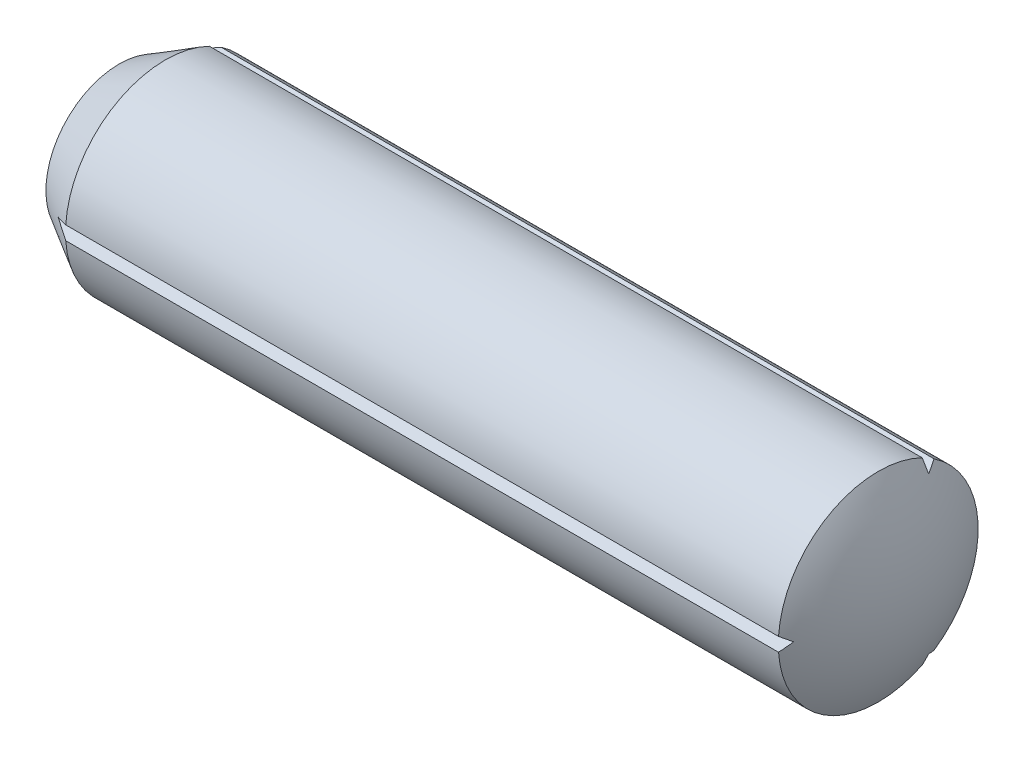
ISO-10303-21;
HEADER;
FILE_DESCRIPTION(('STEP AP214'),'2;1');
FILE_NAME('part.step','',(''),(''),'','','');
FILE_SCHEMA(('AUTOMOTIVE_DESIGN { 1 0 10303 214 1 1 1 1 }'));
ENDSEC;
DATA;
#1=APPLICATION_CONTEXT('core data for automotive mechanical design processes');
#2=APPLICATION_PROTOCOL_DEFINITION('international standard','automotive_design',2000,#1);
#3=PRODUCT_CONTEXT('',#1,'mechanical');
#4=PRODUCT('Part','Part','',(#3));
#5=PRODUCT_RELATED_PRODUCT_CATEGORY('part','',(#4));
#6=PRODUCT_DEFINITION_FORMATION('','',#4);
#7=PRODUCT_DEFINITION_CONTEXT('part definition',#1,'design');
#8=PRODUCT_DEFINITION('design','',#6,#7);
#9=PRODUCT_DEFINITION_SHAPE('','',#8);
#10=(LENGTH_UNIT() NAMED_UNIT(*) SI_UNIT(.MILLI.,.METRE.));
#11=(NAMED_UNIT(*) PLANE_ANGLE_UNIT() SI_UNIT($,.RADIAN.));
#12=(NAMED_UNIT(*) SI_UNIT($,.STERADIAN.) SOLID_ANGLE_UNIT());
#13=UNCERTAINTY_MEASURE_WITH_UNIT(LENGTH_MEASURE(1.E-05),#10,'distance_accuracy_value','');
#14=(GEOMETRIC_REPRESENTATION_CONTEXT(3) GLOBAL_UNCERTAINTY_ASSIGNED_CONTEXT((#13)) GLOBAL_UNIT_ASSIGNED_CONTEXT((#10,
#11,#12)) REPRESENTATION_CONTEXT('',''));
#15=CARTESIAN_POINT('',(0.,0.,0.));
#16=DIRECTION('',(0.,0.,1.));
#17=DIRECTION('',(1.,0.,0.));
#18=AXIS2_PLACEMENT_3D('',#15,#16,#17);
#19=CARTESIAN_POINT('',(-117.,0.,0.));
#20=DIRECTION('',(-1.,0.,0.));
#21=DIRECTION('',(0.,0.,1.));
#22=AXIS2_PLACEMENT_3D('',#19,#20,#21);
#23=CYLINDRICAL_SURFACE('',#22,12.5);
#24=CARTESIAN_POINT('',(-3.34936490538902,0.,0.));
#25=DIRECTION('',(-1.,0.,0.));
#26=DIRECTION('',(0.,0.,1.));
#27=AXIS2_PLACEMENT_3D('',#24,#25,#26);
#28=CIRCLE('',#27,12.5);
#29=CARTESIAN_POINT('',(-3.34936490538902,0.85477161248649,12.4707403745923));
#30=VERTEX_POINT('',#29);
#31=CARTESIAN_POINT('',(-3.34936490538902,11.2273637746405,-5.49511625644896));
#32=VERTEX_POINT('',#31);
#33=EDGE_CURVE('E191',#30,#32,#28,.T.);
#34=ORIENTED_EDGE('',*,*,#33,.T.);
#35=DIRECTION('',(-1.,0.,0.));
#36=VECTOR('',#35,1.);
#37=CARTESIAN_POINT('',(-117.,11.2273637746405,-5.49511625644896));
#38=LINE('',#37,#36);
#39=CARTESIAN_POINT('',(-92.5,11.2273637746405,-5.49511625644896));
#40=VERTEX_POINT('',#39);
#41=EDGE_CURVE('E108',#32,#40,#38,.T.);
#42=ORIENTED_EDGE('',*,*,#41,.T.);
#43=CARTESIAN_POINT('',(-92.5,0.,0.));
#44=DIRECTION('',(-1.,0.,0.));
#45=DIRECTION('',(0.,0.,1.));
#46=AXIS2_PLACEMENT_3D('',#43,#44,#45);
#47=CIRCLE('',#46,12.5);
#48=CARTESIAN_POINT('',(-92.5,0.854771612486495,12.4707403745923));
#49=VERTEX_POINT('',#48);
#50=EDGE_CURVE('E120',#49,#40,#47,.T.);
#51=ORIENTED_EDGE('',*,*,#50,.F.);
#52=DIRECTION('',(-1.,0.,0.));
#53=VECTOR('',#52,1.);
#54=CARTESIAN_POINT('',(-117.,0.854771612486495,12.4707403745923));
#55=LINE('',#54,#53);
#56=EDGE_CURVE('E162',#49,#30,#55,.F.);
#57=ORIENTED_EDGE('',*,*,#56,.T.);
#58=EDGE_LOOP('',(#34,#42,#51,#57));
#59=FACE_BOUND('',#58,.T.);
#60=ADVANCED_FACE('F32',(#59),#23,.T.);
#61=CARTESIAN_POINT('',(-92.5,10.372592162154,-6.97562411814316));
#62=VERTEX_POINT('',#61);
#63=CARTESIAN_POINT('',(-92.5,-10.3725921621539,-6.97562411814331));
#64=VERTEX_POINT('',#63);
#65=EDGE_CURVE('E204',#62,#64,#47,.T.);
#66=ORIENTED_EDGE('',*,*,#65,.F.);
#67=DIRECTION('',(-1.,0.,0.));
#68=VECTOR('',#67,1.);
#69=CARTESIAN_POINT('',(-117.,10.372592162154,-6.97562411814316));
#70=LINE('',#69,#68);
#71=CARTESIAN_POINT('',(-3.34936490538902,10.372592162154,-6.97562411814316));
#72=VERTEX_POINT('',#71);
#73=EDGE_CURVE('E104',#62,#72,#70,.F.);
#74=ORIENTED_EDGE('',*,*,#73,.T.);
#75=CARTESIAN_POINT('',(-3.34936490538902,-10.3725921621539,-6.97562411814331));
#76=VERTEX_POINT('',#75);
#77=EDGE_CURVE('E195',#72,#76,#28,.T.);
#78=ORIENTED_EDGE('',*,*,#77,.T.);
#79=DIRECTION('',(-1.,0.,0.));
#80=VECTOR('',#79,1.);
#81=CARTESIAN_POINT('',(-117.,-10.3725921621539,-6.97562411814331));
#82=LINE('',#81,#80);
#83=EDGE_CURVE('E151',#76,#64,#82,.T.);
#84=ORIENTED_EDGE('',*,*,#83,.T.);
#85=EDGE_LOOP('',(#66,#74,#78,#84));
#86=FACE_BOUND('',#85,.T.);
#87=ADVANCED_FACE('F219',(#86),#23,.T.);
#88=CARTESIAN_POINT('',(-92.5,-11.2273637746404,-5.49511625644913));
#89=VERTEX_POINT('',#88);
#90=CARTESIAN_POINT('',(-92.5,-0.854771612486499,12.4707403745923));
#91=VERTEX_POINT('',#90);
#92=EDGE_CURVE('E201',#89,#91,#47,.T.);
#93=ORIENTED_EDGE('',*,*,#92,.F.);
#94=DIRECTION('',(-1.,0.,0.));
#95=VECTOR('',#94,1.);
#96=CARTESIAN_POINT('',(-117.,-11.2273637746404,-5.49511625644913));
#97=LINE('',#96,#95);
#98=CARTESIAN_POINT('',(-3.34936490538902,-11.2273637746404,-5.49511625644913));
#99=VERTEX_POINT('',#98);
#100=EDGE_CURVE('E122',#89,#99,#97,.F.);
#101=ORIENTED_EDGE('',*,*,#100,.T.);
#102=CARTESIAN_POINT('',(-3.34936490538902,-0.854771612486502,12.4707403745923));
#103=VERTEX_POINT('',#102);
#104=EDGE_CURVE('E190',#99,#103,#28,.T.);
#105=ORIENTED_EDGE('',*,*,#104,.T.);
#106=DIRECTION('',(-1.,0.,0.));
#107=VECTOR('',#106,1.);
#108=CARTESIAN_POINT('',(-117.,-0.854771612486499,12.4707403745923));
#109=LINE('',#108,#107);
#110=EDGE_CURVE('E170',#103,#91,#109,.T.);
#111=ORIENTED_EDGE('',*,*,#110,.T.);
#112=EDGE_LOOP('',(#93,#101,#105,#111));
#113=FACE_BOUND('',#112,.T.);
#114=ADVANCED_FACE('F34',(#113),#23,.T.);
#115=CARTESIAN_POINT('',(-92.5,0.,0.));
#116=DIRECTION('',(1.,0.,0.));
#117=DIRECTION('',(0.,0.,-1.));
#118=AXIS2_PLACEMENT_3D('',#115,#116,#117);
#119=CONICAL_SURFACE('',#118,12.5,0.523598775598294);
#120=CARTESIAN_POINT('',(-98.2949571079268,0.,0.));
#121=DIRECTION('',(-1.,0.,0.));
#122=DIRECTION('',(0.,0.,1.));
#123=AXIS2_PLACEMENT_3D('',#120,#121,#122);
#124=CIRCLE('',#123,9.15427995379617);
#125=CARTESIAN_POINT('',(-98.2949571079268,9.15427995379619,0.));
#126=VERTEX_POINT('',#125);
#127=EDGE_CURVE('E198',#126,#126,#124,.T.);
#128=ORIENTED_EDGE('',*,*,#127,.F.);
#129=EDGE_LOOP('',(#128));
#130=FACE_BOUND('',#129,.T.);
#131=ORIENTED_EDGE('',*,*,#50,.T.);
#132=CARTESIAN_POINT('',(-92.4998,11.2274980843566,-5.49510450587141));
#133=CARTESIAN_POINT('',(-92.6814628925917,11.1055002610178,-5.50577793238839));
#134=CARTESIAN_POINT('',(-92.8628690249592,10.9831221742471,-5.51648462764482));
#135=CARTESIAN_POINT('',(-93.2251005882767,10.7375265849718,-5.53797145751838));
#136=CARTESIAN_POINT('',(-93.405926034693,10.6143091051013,-5.54875159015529));
#137=CARTESIAN_POINT('',(-93.7669395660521,10.366948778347,-5.57039281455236));
#138=CARTESIAN_POINT('',(-93.9471276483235,10.2428059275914,-5.58125390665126));
#139=CARTESIAN_POINT('',(-94.3067923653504,9.99349162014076,-5.60306608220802));
#140=CARTESIAN_POINT('',(-94.4862689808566,9.8683201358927,-5.61401716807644));
#141=CARTESIAN_POINT('',(-94.6653483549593,9.74258579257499,-5.62501749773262));
#142=B_SPLINE_CURVE_WITH_KNOTS('',3,(#132,#133,#134,#135,#136,#137,#138,#139,#140,#141),
.UNSPECIFIED.,.F.,.F.,(4,2,2,2,4),(0.,0.657259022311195,1.31450039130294,1.97174451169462,
2.62900629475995),.UNSPECIFIED.);
#143=CARTESIAN_POINT('',(-94.6650635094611,9.74278579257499,-5.62499999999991));
#144=VERTEX_POINT('',#143);
#145=EDGE_CURVE('E112',#40,#144,#142,.T.);
#146=ORIENTED_EDGE('',*,*,#145,.T.);
#147=CARTESIAN_POINT('',(-94.665376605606,9.74269253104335,-5.62479999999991));
#148=CARTESIAN_POINT('',(-94.486294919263,9.79603386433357,-5.73919085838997));
#149=CARTESIAN_POINT('',(-94.3068159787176,9.84913640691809,-5.85306962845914));
#150=CARTESIAN_POINT('',(-93.947146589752,9.95490508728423,-6.07989129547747));
#151=CARTESIAN_POINT('',(-93.7669561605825,10.0075712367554,-6.19283421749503));
#152=CARTESIAN_POINT('',(-93.4059379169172,10.1125109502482,-6.41787815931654));
#153=CARTESIAN_POINT('',(-93.2251101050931,10.1647845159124,-6.52997918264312));
#154=CARTESIAN_POINT('',(-92.8628737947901,10.2689755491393,-6.75341757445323));
#155=CARTESIAN_POINT('',(-92.6814652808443,10.3208930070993,-6.86475492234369));
#156=CARTESIAN_POINT('',(-92.4998,10.3726491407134,-6.97574630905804));
#157=B_SPLINE_CURVE_WITH_KNOTS('',3,(#147,#148,#149,#150,#151,#152,#153,#154,#155,#156),
.UNSPECIFIED.,.F.,.F.,(4,2,2,2,4),(0.,0.657270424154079,1.31452318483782,1.97177319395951,
2.62904085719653),.UNSPECIFIED.);
#158=EDGE_CURVE('E101',#144,#62,#157,.T.);
#159=ORIENTED_EDGE('',*,*,#158,.T.);
#160=ORIENTED_EDGE('',*,*,#65,.T.);
#161=CARTESIAN_POINT('',(-92.4998,-10.3726491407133,-6.97574630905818));
#162=CARTESIAN_POINT('',(-92.6814652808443,-10.3208930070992,-6.86475492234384));
#163=CARTESIAN_POINT('',(-92.8628737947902,-10.2689755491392,-6.75341757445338));
#164=CARTESIAN_POINT('',(-93.2251101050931,-10.1647845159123,-6.52997918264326));
#165=CARTESIAN_POINT('',(-93.4059379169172,-10.1125109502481,-6.41787815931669));
#166=CARTESIAN_POINT('',(-93.7669561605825,-10.0075712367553,-6.19283421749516));
#167=CARTESIAN_POINT('',(-93.947146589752,-9.95490508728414,-6.07989129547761));
#168=CARTESIAN_POINT('',(-94.3068159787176,-9.84913640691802,-5.85306962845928));
#169=CARTESIAN_POINT('',(-94.486294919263,-9.79603386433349,-5.73919085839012));
#170=CARTESIAN_POINT('',(-94.665376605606,-9.74269253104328,-5.62480000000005));
#171=B_SPLINE_CURVE_WITH_KNOTS('',3,(#161,#162,#163,#164,#165,#166,#167,#168,#169,#170),
.UNSPECIFIED.,.F.,.F.,(4,2,2,2,4),(0.,0.657267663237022,1.31451767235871,1.97177043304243,
2.62904085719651),.UNSPECIFIED.);
#172=CARTESIAN_POINT('',(-94.6650635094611,-9.74278579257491,-5.62500000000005));
#173=VERTEX_POINT('',#172);
#174=EDGE_CURVE('E154',#64,#173,#171,.T.);
#175=ORIENTED_EDGE('',*,*,#174,.T.);
#176=CARTESIAN_POINT('',(-94.6653483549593,-9.74258579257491,-5.62501749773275));
#177=CARTESIAN_POINT('',(-94.4862689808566,-9.86832013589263,-5.61401716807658));
#178=CARTESIAN_POINT('',(-94.3067923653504,-9.99349162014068,-5.60306608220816));
#179=CARTESIAN_POINT('',(-93.9471276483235,-10.2428059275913,-5.58125390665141));
#180=CARTESIAN_POINT('',(-93.7669395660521,-10.3669487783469,-5.57039281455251));
#181=CARTESIAN_POINT('',(-93.405926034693,-10.6143091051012,-5.54875159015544));
#182=CARTESIAN_POINT('',(-93.2251005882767,-10.7375265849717,-5.53797145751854));
#183=CARTESIAN_POINT('',(-92.8628690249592,-10.983122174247,-5.51648462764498));
#184=CARTESIAN_POINT('',(-92.6814628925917,-11.1055002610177,-5.50577793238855));
#185=CARTESIAN_POINT('',(-92.4998,-11.2274980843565,-5.49510450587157));
#186=B_SPLINE_CURVE_WITH_KNOTS('',3,(#176,#177,#178,#179,#180,#181,#182,#183,#184,#185),
.UNSPECIFIED.,.F.,.F.,(4,2,2,2,4),(0.,0.657261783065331,1.31450590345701,1.97174727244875,
2.62900629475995),.UNSPECIFIED.);
#187=EDGE_CURVE('E145',#173,#89,#186,.T.);
#188=ORIENTED_EDGE('',*,*,#187,.T.);
#189=ORIENTED_EDGE('',*,*,#92,.T.);
#190=CARTESIAN_POINT('',(-92.4998,-0.854848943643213,12.4708508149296));
#191=CARTESIAN_POINT('',(-92.681468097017,-0.784604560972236,12.3705314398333));
#192=CARTESIAN_POINT('',(-92.8628794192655,-0.714141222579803,12.2698993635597));
#193=CARTESIAN_POINT('',(-93.2251213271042,-0.572731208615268,12.0679449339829));
#194=CARTESIAN_POINT('',(-93.4059519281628,-0.501784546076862,11.9666225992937));
#195=CARTESIAN_POINT('',(-93.7669757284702,-0.35935839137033,11.7632169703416));
#196=CARTESIAN_POINT('',(-93.9471689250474,-0.287878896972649,11.6611336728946));
#197=CARTESIAN_POINT('',(-94.3068438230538,-0.144327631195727,11.45612121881));
#198=CARTESIAN_POINT('',(-94.4863255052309,-0.0722558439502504,11.353192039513));
#199=CARTESIAN_POINT('',(-94.6654099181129,0.000140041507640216,11.2498));
#200=B_SPLINE_CURVE_WITH_KNOTS('',3,(#190,#191,#192,#193,#194,#195,#196,#197,#198,#199),
.UNSPECIFIED.,.F.,.F.,(4,2,2,2,4),(0.,0.657277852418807,1.31453804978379,1.97180099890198,
2.62908161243),.UNSPECIFIED.);
#201=CARTESIAN_POINT('',(-94.6650635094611,0.,11.25));
#202=VERTEX_POINT('',#201);
#203=EDGE_CURVE('E184',#91,#202,#200,.T.);
#204=ORIENTED_EDGE('',*,*,#203,.T.);
#205=CARTESIAN_POINT('',(-94.6654099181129,-0.00014004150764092,11.2498));
#206=CARTESIAN_POINT('',(-94.4863255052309,0.072255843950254,11.353192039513));
#207=CARTESIAN_POINT('',(-94.3068438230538,0.144327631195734,11.45612121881));
#208=CARTESIAN_POINT('',(-93.9471689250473,0.287878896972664,11.6611336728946));
#209=CARTESIAN_POINT('',(-93.7669757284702,0.35935839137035,11.7632169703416));
#210=CARTESIAN_POINT('',(-93.4059519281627,0.50178454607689,11.9666225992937));
#211=CARTESIAN_POINT('',(-93.2251213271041,0.572731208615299,12.0679449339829));
#212=CARTESIAN_POINT('',(-92.8628794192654,0.714141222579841,12.2698993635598));
#213=CARTESIAN_POINT('',(-92.6814680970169,0.784604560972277,12.3705314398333));
#214=CARTESIAN_POINT('',(-92.4997999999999,0.854848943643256,12.4708508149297));
#215=B_SPLINE_CURVE_WITH_KNOTS('',3,(#205,#206,#207,#208,#209,#210,#211,#212,#213,#214),
.UNSPECIFIED.,.F.,.F.,(4,2,2,2,4),(0.,0.657280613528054,1.3145435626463,1.97180376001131,
2.62908161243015),.UNSPECIFIED.);
#216=EDGE_CURVE('E165',#202,#49,#215,.T.);
#217=ORIENTED_EDGE('',*,*,#216,.T.);
#218=EDGE_LOOP('',(#131,#146,#159,#160,#175,#188,#189,#204,#217));
#219=FACE_BOUND('',#218,.T.);
#220=ADVANCED_FACE('F117',(#130,#219),#119,.T.);
#221=CARTESIAN_POINT('',(-75.0312695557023,0.,0.));
#222=DIRECTION('',(-1.,0.,0.));
#223=DIRECTION('',(0.,1.,0.));
#224=AXIS2_PLACEMENT_3D('',#221,#222,#223);
#225=SPHERICAL_SURFACE('',#224,25.);
#226=CARTESIAN_POINT('',(-100.,0.,0.));
#227=DIRECTION('',(-1.,0.,0.));
#228=DIRECTION('',(0.,0.,1.));
#229=AXIS2_PLACEMENT_3D('',#226,#227,#228);
#230=CIRCLE('',#229,1.25);
#231=CARTESIAN_POINT('',(-100.,1.25000000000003,0.));
#232=VERTEX_POINT('',#231);
#233=EDGE_CURVE('E194',#232,#232,#230,.T.);
#234=CARTESIAN_POINT('',(-100.,1.25000000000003,0.));
#235=CARTESIAN_POINT('',(-99.9957699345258,1.33449580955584,0.));
#236=CARTESIAN_POINT('',(-99.9911109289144,1.41897014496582,0.));
#237=CARTESIAN_POINT('',(-99.9809355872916,1.58786716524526,0.));
#238=CARTESIAN_POINT('',(-99.9754192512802,1.67228985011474,0.));
#239=CARTESIAN_POINT('',(-99.9635297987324,1.84107486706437,0.));
#240=CARTESIAN_POINT('',(-99.9571566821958,1.92543719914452,0.));
#241=CARTESIAN_POINT('',(-99.9435543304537,2.09409281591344,0.));
#242=CARTESIAN_POINT('',(-99.9363250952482,2.1783861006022,0.));
#243=CARTESIAN_POINT('',(-99.9210112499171,2.34689493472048,0.));
#244=CARTESIAN_POINT('',(-99.9129266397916,2.43111048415,0.));
#245=CARTESIAN_POINT('',(-99.8959028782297,2.59945516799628,0.));
#246=CARTESIAN_POINT('',(-99.8869637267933,2.68358430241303,0.));
#247=CARTESIAN_POINT('',(-99.8682318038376,2.85174748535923,0.));
#248=CARTESIAN_POINT('',(-99.8584390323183,2.93578153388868,0.));
#249=CARTESIAN_POINT('',(-99.8380008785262,3.10374588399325,0.));
#250=CARTESIAN_POINT('',(-99.8273554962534,3.18767618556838,0.));
#251=CARTESIAN_POINT('',(-99.8052132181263,3.3554243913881,0.));
#252=CARTESIAN_POINT('',(-99.7937163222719,3.4392422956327,0.));
#253=CARTESIAN_POINT('',(-99.7698722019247,3.60675706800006,0.));
#254=CARTESIAN_POINT('',(-99.7575249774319,3.69045393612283,0.));
#255=CARTESIAN_POINT('',(-99.7319814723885,3.85771800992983,0.));
#256=CARTESIAN_POINT('',(-99.7187851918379,3.94128521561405,0.));
#257=CARTESIAN_POINT('',(-99.6915449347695,4.10828135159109,0.));
#258=CARTESIAN_POINT('',(-99.6775009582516,4.19171028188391,0.));
#259=CARTESIAN_POINT('',(-99.6485667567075,4.35842126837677,0.));
#260=CARTESIAN_POINT('',(-99.6336765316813,4.44170332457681,0.));
#261=CARTESIAN_POINT('',(-99.6030513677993,4.60811197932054,0.));
#262=CARTESIAN_POINT('',(-99.5873164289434,4.69123857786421,0.));
#263=CARTESIAN_POINT('',(-99.5550034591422,4.85732774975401,0.));
#264=CARTESIAN_POINT('',(-99.5384254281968,4.94029032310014,0.));
#265=CARTESIAN_POINT('',(-99.5044279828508,5.10604289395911,0.));
#266=CARTESIAN_POINT('',(-99.4870085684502,5.18883289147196,0.));
#267=CARTESIAN_POINT('',(-99.4513301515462,5.35423177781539,0.));
#268=CARTESIAN_POINT('',(-99.433071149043,5.43684066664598,0.));
#269=CARTESIAN_POINT('',(-99.3957154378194,5.60186882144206,0.));
#270=CARTESIAN_POINT('',(-99.3766187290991,5.68428808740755,0.));
#271=CARTESIAN_POINT('',(-99.3375895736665,5.84892850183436,0.));
#272=CARTESIAN_POINT('',(-99.3176571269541,5.93114965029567,0.));
#273=CARTESIAN_POINT('',(-99.2769585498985,6.09538535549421,0.));
#274=CARTESIAN_POINT('',(-99.2561924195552,6.17739991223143,0.));
#275=CARTESIAN_POINT('',(-99.2138286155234,6.34121398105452,0.));
#276=CARTESIAN_POINT('',(-99.192230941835,6.42301349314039,0.));
#277=CARTESIAN_POINT('',(-99.1482062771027,6.58638904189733,0.));
#278=CARTESIAN_POINT('',(-99.125779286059,6.66796507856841,0.));
#279=CARTESIAN_POINT('',(-99.0800982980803,6.83088526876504,0.));
#280=CARTESIAN_POINT('',(-99.0568443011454,6.91222942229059,0.));
#281=CARTESIAN_POINT('',(-99.0095116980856,7.07467746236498,0.));
#282=CARTESIAN_POINT('',(-98.9854330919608,7.15578134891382,0.));
#283=CARTESIAN_POINT('',(-98.9364537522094,7.31774049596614,0.));
#284=CARTESIAN_POINT('',(-98.9115530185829,7.39859575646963,0.));
#285=CARTESIAN_POINT('',(-98.8609319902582,7.56004931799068,0.));
#286=CARTESIAN_POINT('',(-98.83521169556,7.64064761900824,0.));
#287=CARTESIAN_POINT('',(-98.7829541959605,7.80157895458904,0.));
#288=CARTESIAN_POINT('',(-98.7564169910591,7.88191198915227,0.));
#289=CARTESIAN_POINT('',(-98.7025284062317,8.04230451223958,0.));
#290=CARTESIAN_POINT('',(-98.6751770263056,8.12236400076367,0.));
#291=CARTESIAN_POINT('',(-98.6196629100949,8.28220118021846,0.));
#292=CARTESIAN_POINT('',(-98.5915001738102,8.36197887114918,0.));
#293=CARTESIAN_POINT('',(-98.5343662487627,8.52124423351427,0.));
#294=CARTESIAN_POINT('',(-98.5053950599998,8.60073190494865,0.));
#295=CARTESIAN_POINT('',(-98.4466472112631,8.75940903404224,0.));
#296=CARTESIAN_POINT('',(-98.4168705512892,8.83859849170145,0.));
#297=CARTESIAN_POINT('',(-98.3565148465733,8.99667103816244,0.));
#298=CARTESIAN_POINT('',(-98.3259358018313,9.07555412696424,0.));
#299=CARTESIAN_POINT('',(-98.2949571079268,9.15427995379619,0.));
#300=B_SPLINE_CURVE_WITH_KNOTS('',3,(#234,#235,#236,#237,#238,#239,#240,#241,#242,#243,#244,
#245,#246,#247,#248,#249,#250,#251,#252,#253,#254,#255,#256,#257,#258,#259,#260,#261,#262,#263,
#264,#265,#266,#267,#268,#269,#270,#271,#272,#273,#274,#275,#276,#277,#278,#279,#280,#281,#282,
#283,#284,#285,#286,#287,#288,#289,#290,#291,#292,#293,#294,#295,#296,#297,#298,#299),
.UNSPECIFIED.,.F.,.F.,(4,2,2,2,2,2,2,2,2,2,2,2,2,2,2,2,2,2,2,2,2,2,2,2,2,2,2,2,2,2,2,2,4),(0.,
0.253803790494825,0.507607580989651,0.761411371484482,1.01521516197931,1.26901895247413,
1.52282274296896,1.77662653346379,2.03043032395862,2.28423411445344,2.53803790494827,
2.7918416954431,3.04564548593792,3.29944927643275,3.55325306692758,3.8070568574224,
4.06086064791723,4.31466443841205,4.56846822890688,4.82227201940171,5.07607580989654,
5.32987960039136,5.58368339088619,5.83748718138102,6.09129097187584,6.34509476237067,
6.5988985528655,6.85270234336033,7.10650613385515,7.36030992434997,7.61411371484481,
7.86791750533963,8.12172129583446),.UNSPECIFIED.);
#301=EDGE_CURVE('BSEAM244',#232,#126,#300,.T.);
#302=ORIENTED_EDGE('',*,*,#233,.F.);
#303=ORIENTED_EDGE('',*,*,#127,.T.);
#304=ORIENTED_EDGE('',*,*,#301,.T.);
#305=ORIENTED_EDGE('',*,*,#301,.F.);
#306=EDGE_LOOP('',(#302,#304,#303,#305));
#307=FACE_BOUND('',#306,.T.);
#308=ADVANCED_FACE('F244',(#307),#225,.T.);
#309=CARTESIAN_POINT('',(-100.,0.,0.));
#310=DIRECTION('',(1.,0.,0.));
#311=DIRECTION('',(0.,0.,-1.));
#312=AXIS2_PLACEMENT_3D('',#309,#310,#311);
#313=PLANE('',#312);
#314=ORIENTED_EDGE('',*,*,#233,.T.);
#315=EDGE_LOOP('',(#314));
#316=FACE_BOUND('',#315,.T.);
#317=ADVANCED_FACE('F249',(#316),#313,.F.);
#318=CARTESIAN_POINT('',(-25.,0.,0.));
#319=DIRECTION('',(-1.,0.,0.));
#320=DIRECTION('',(0.,1.,0.));
#321=AXIS2_PLACEMENT_3D('',#318,#319,#320);
#322=SPHERICAL_SURFACE('',#321,25.);
#323=CARTESIAN_POINT('',(-25.,5.84816389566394,2.72704361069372));
#324=DIRECTION('',(0.,-0.906307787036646,-0.422618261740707));
#325=DIRECTION('',(0.,0.422618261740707,-0.906307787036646));
#326=AXIS2_PLACEMENT_3D('',#323,#324,#325);
#327=CIRCLE('',#326,24.1528924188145);
#328=CARTESIAN_POINT('',(-2.67428612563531,9.74278579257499,-5.62499999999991));
#329=VERTEX_POINT('',#328);
#330=EDGE_CURVE('E40',#72,#329,#327,.T.);
#331=ORIENTED_EDGE('',*,*,#330,.T.);
#332=CARTESIAN_POINT('',(-25.,0.562392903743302,-6.42818030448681));
#333=DIRECTION('',(0.,-0.0871557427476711,0.996194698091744));
#334=DIRECTION('',(0.,-0.996194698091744,-0.0871557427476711));
#335=AXIS2_PLACEMENT_3D('',#332,#333,#334);
#336=CIRCLE('',#335,24.1528924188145);
#337=EDGE_CURVE('E11',#329,#32,#336,.T.);
#338=ORIENTED_EDGE('',*,*,#337,.T.);
#339=ORIENTED_EDGE('',*,*,#33,.F.);
#340=CARTESIAN_POINT('',(-25.,-5.28577099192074,3.70113669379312));
#341=DIRECTION('',(0.,0.819152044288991,-0.573576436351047));
#342=DIRECTION('',(0.,0.573576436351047,0.819152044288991));
#343=AXIS2_PLACEMENT_3D('',#340,#341,#342);
#344=CIRCLE('',#343,24.1528924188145);
#345=CARTESIAN_POINT('',(-2.6742861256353,0.,11.25));
#346=VERTEX_POINT('',#345);
#347=EDGE_CURVE('E203',#30,#346,#344,.T.);
#348=ORIENTED_EDGE('',*,*,#347,.T.);
#349=CARTESIAN_POINT('',(-25.,5.28577099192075,3.70113669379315));
#350=DIRECTION('',(0.,-0.81915204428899,-0.573576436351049));
#351=DIRECTION('',(0.,0.573576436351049,-0.81915204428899));
#352=AXIS2_PLACEMENT_3D('',#349,#350,#351);
#353=CIRCLE('',#352,24.1528924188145);
#354=EDGE_CURVE('E207',#346,#103,#353,.T.);
#355=ORIENTED_EDGE('',*,*,#354,.T.);
#356=ORIENTED_EDGE('',*,*,#104,.F.);
#357=CARTESIAN_POINT('',(-25.,-0.562392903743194,-6.4281803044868));
#358=DIRECTION('',(0.,0.0871557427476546,0.996194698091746));
#359=DIRECTION('',(0.,-0.996194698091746,0.0871557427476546));
#360=AXIS2_PLACEMENT_3D('',#357,#358,#359);
#361=CIRCLE('',#360,24.1528924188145);
#362=CARTESIAN_POINT('',(-2.67428612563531,-9.74278579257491,-5.62500000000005));
#363=VERTEX_POINT('',#362);
#364=EDGE_CURVE('E210',#99,#363,#361,.T.);
#365=ORIENTED_EDGE('',*,*,#364,.T.);
#366=CARTESIAN_POINT('',(-25.,-5.84816389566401,2.72704361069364));
#367=DIRECTION('',(0.,0.906307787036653,-0.422618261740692));
#368=DIRECTION('',(0.,0.422618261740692,0.906307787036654));
#369=AXIS2_PLACEMENT_3D('',#366,#367,#368);
#370=CIRCLE('',#369,24.1528924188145);
#371=EDGE_CURVE('E213',#363,#76,#370,.T.);
#372=ORIENTED_EDGE('',*,*,#371,.T.);
#373=ORIENTED_EDGE('',*,*,#77,.F.);
#374=EDGE_LOOP('',(#331,#338,#339,#348,#355,#356,#365,#372,#373));
#375=FACE_BOUND('',#374,.T.);
#376=ADVANCED_FACE('F181',(#375),#322,.T.);
#377=CARTESIAN_POINT('',(-100.,0.,11.25));
#378=DIRECTION('',(0.,-0.81915204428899,-0.573576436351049));
#379=DIRECTION('',(0.,0.573576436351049,-0.81915204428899));
#380=AXIS2_PLACEMENT_3D('',#377,#378,#379);
#381=PLANE('',#380);
#382=ORIENTED_EDGE('',*,*,#110,.F.);
#383=ORIENTED_EDGE('',*,*,#354,.F.);
#384=DIRECTION('',(1.,0.,0.));
#385=VECTOR('',#384,1.);
#386=CARTESIAN_POINT('',(-100.,0.,11.25));
#387=LINE('',#386,#385);
#388=EDGE_CURVE('E160',#202,#346,#387,.T.);
#389=ORIENTED_EDGE('',*,*,#388,.F.);
#390=ORIENTED_EDGE('',*,*,#203,.F.);
#391=EDGE_LOOP('',(#382,#383,#389,#390));
#392=FACE_BOUND('',#391,.T.);
#393=ADVANCED_FACE('F176',(#392),#381,.F.);
#394=CARTESIAN_POINT('',(-100.,0.,11.25));
#395=DIRECTION('',(0.,0.819152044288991,-0.573576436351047));
#396=DIRECTION('',(0.,0.573576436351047,0.819152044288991));
#397=AXIS2_PLACEMENT_3D('',#394,#395,#396);
#398=PLANE('',#397);
#399=ORIENTED_EDGE('',*,*,#388,.T.);
#400=ORIENTED_EDGE('',*,*,#347,.F.);
#401=ORIENTED_EDGE('',*,*,#56,.F.);
#402=ORIENTED_EDGE('',*,*,#216,.F.);
#403=EDGE_LOOP('',(#399,#400,#401,#402));
#404=FACE_BOUND('',#403,.T.);
#405=ADVANCED_FACE('F172',(#404),#398,.F.);
#406=CARTESIAN_POINT('',(-100.,-9.74278579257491,-5.62500000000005));
#407=DIRECTION('',(0.,0.906307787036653,-0.422618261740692));
#408=DIRECTION('',(0.,0.422618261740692,0.906307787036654));
#409=AXIS2_PLACEMENT_3D('',#406,#407,#408);
#410=PLANE('',#409);
#411=ORIENTED_EDGE('',*,*,#83,.F.);
#412=ORIENTED_EDGE('',*,*,#371,.F.);
#413=DIRECTION('',(1.,0.,0.));
#414=VECTOR('',#413,1.);
#415=CARTESIAN_POINT('',(-100.,-9.74278579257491,-5.62500000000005));
#416=LINE('',#415,#414);
#417=EDGE_CURVE('E55',#173,#363,#416,.T.);
#418=ORIENTED_EDGE('',*,*,#417,.F.);
#419=ORIENTED_EDGE('',*,*,#174,.F.);
#420=EDGE_LOOP('',(#411,#412,#418,#419));
#421=FACE_BOUND('',#420,.T.);
#422=ADVANCED_FACE('F141',(#421),#410,.F.);
#423=CARTESIAN_POINT('',(-100.,-9.74278579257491,-5.62500000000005));
#424=DIRECTION('',(0.,0.0871557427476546,0.996194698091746));
#425=DIRECTION('',(0.,-0.996194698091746,0.0871557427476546));
#426=AXIS2_PLACEMENT_3D('',#423,#424,#425);
#427=PLANE('',#426);
#428=ORIENTED_EDGE('',*,*,#417,.T.);
#429=ORIENTED_EDGE('',*,*,#364,.F.);
#430=ORIENTED_EDGE('',*,*,#100,.F.);
#431=ORIENTED_EDGE('',*,*,#187,.F.);
#432=EDGE_LOOP('',(#428,#429,#430,#431));
#433=FACE_BOUND('',#432,.T.);
#434=ADVANCED_FACE('F136',(#433),#427,.F.);
#435=CARTESIAN_POINT('',(-100.,9.74278579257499,-5.62499999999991));
#436=DIRECTION('',(0.,-0.0871557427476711,0.996194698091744));
#437=DIRECTION('',(0.,-0.996194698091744,-0.0871557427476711));
#438=AXIS2_PLACEMENT_3D('',#435,#436,#437);
#439=PLANE('',#438);
#440=ORIENTED_EDGE('',*,*,#41,.F.);
#441=ORIENTED_EDGE('',*,*,#337,.F.);
#442=DIRECTION('',(1.,0.,0.));
#443=VECTOR('',#442,1.);
#444=CARTESIAN_POINT('',(-100.,9.74278579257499,-5.62499999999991));
#445=LINE('',#444,#443);
#446=EDGE_CURVE('E47',#144,#329,#445,.T.);
#447=ORIENTED_EDGE('',*,*,#446,.F.);
#448=ORIENTED_EDGE('',*,*,#145,.F.);
#449=EDGE_LOOP('',(#440,#441,#447,#448));
#450=FACE_BOUND('',#449,.T.);
#451=ADVANCED_FACE('F111',(#450),#439,.F.);
#452=CARTESIAN_POINT('',(-100.,9.74278579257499,-5.62499999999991));
#453=DIRECTION('',(0.,-0.906307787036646,-0.422618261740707));
#454=DIRECTION('',(0.,0.422618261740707,-0.906307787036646));
#455=AXIS2_PLACEMENT_3D('',#452,#453,#454);
#456=PLANE('',#455);
#457=ORIENTED_EDGE('',*,*,#446,.T.);
#458=ORIENTED_EDGE('',*,*,#330,.F.);
#459=ORIENTED_EDGE('',*,*,#73,.F.);
#460=ORIENTED_EDGE('',*,*,#158,.F.);
#461=EDGE_LOOP('',(#457,#458,#459,#460));
#462=FACE_BOUND('',#461,.T.);
#463=ADVANCED_FACE('F102',(#462),#456,.F.);
#464=CLOSED_SHELL('',(#60,#87,#114,#220,#308,#317,#376,#393,#405,#422,#434,#451,#463));
#465=MANIFOLD_SOLID_BREP('B2',#464);
#466=ADVANCED_BREP_SHAPE_REPRESENTATION('',(#18,#465),#14);
#467=SHAPE_DEFINITION_REPRESENTATION(#9,#466);
ENDSEC;
END-ISO-10303-21;
